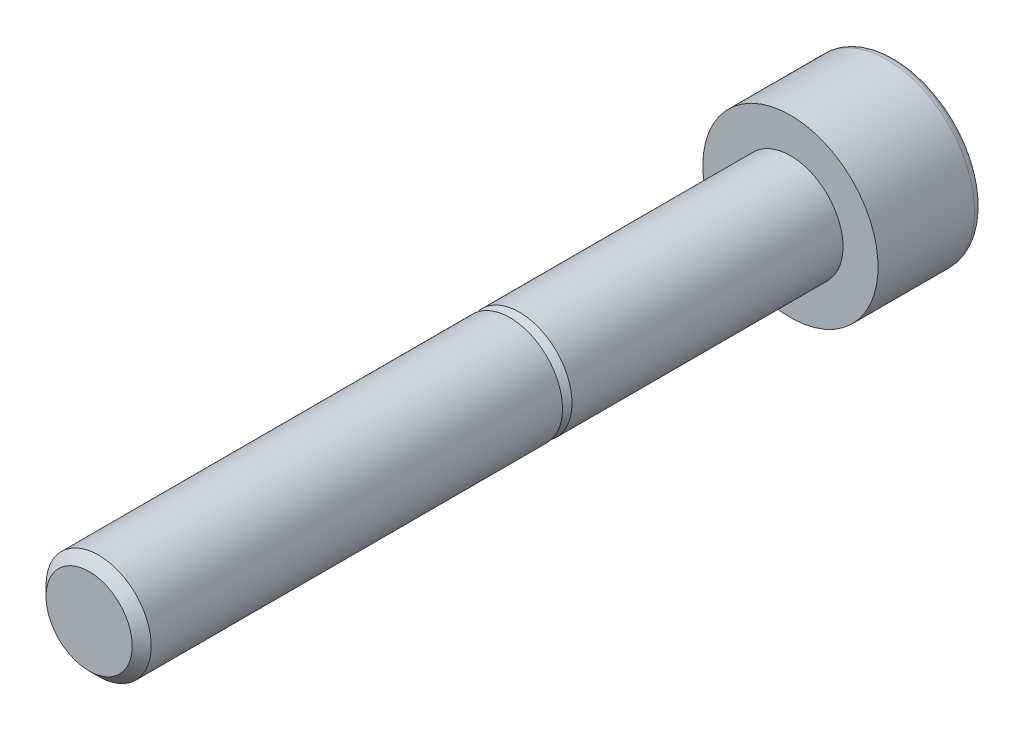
ISO-10303-21;
HEADER;
FILE_DESCRIPTION(('STEP AP214'),'2;1');
FILE_NAME('part.step','',(''),(''),'','','');
FILE_SCHEMA(('AUTOMOTIVE_DESIGN { 1 0 10303 214 1 1 1 1 }'));
ENDSEC;
DATA;
#1=APPLICATION_CONTEXT('core data for automotive mechanical design processes');
#2=APPLICATION_PROTOCOL_DEFINITION('international standard','automotive_design',2000,#1);
#3=PRODUCT_CONTEXT('',#1,'mechanical');
#4=PRODUCT('Part','Part','',(#3));
#5=PRODUCT_RELATED_PRODUCT_CATEGORY('part','',(#4));
#6=PRODUCT_DEFINITION_FORMATION('','',#4);
#7=PRODUCT_DEFINITION_CONTEXT('part definition',#1,'design');
#8=PRODUCT_DEFINITION('design','',#6,#7);
#9=PRODUCT_DEFINITION_SHAPE('','',#8);
#10=(LENGTH_UNIT() NAMED_UNIT(*) SI_UNIT(.MILLI.,.METRE.));
#11=(NAMED_UNIT(*) PLANE_ANGLE_UNIT() SI_UNIT($,.RADIAN.));
#12=(NAMED_UNIT(*) SI_UNIT($,.STERADIAN.) SOLID_ANGLE_UNIT());
#13=UNCERTAINTY_MEASURE_WITH_UNIT(LENGTH_MEASURE(1.E-05),#10,'distance_accuracy_value','');
#14=(GEOMETRIC_REPRESENTATION_CONTEXT(3) GLOBAL_UNCERTAINTY_ASSIGNED_CONTEXT((#13)) GLOBAL_UNIT_ASSIGNED_CONTEXT((#10,
#11,#12)) REPRESENTATION_CONTEXT('',''));
#15=CARTESIAN_POINT('',(0.,0.,0.));
#16=DIRECTION('',(0.,0.,1.));
#17=DIRECTION('',(1.,0.,0.));
#18=AXIS2_PLACEMENT_3D('',#15,#16,#17);
#19=CARTESIAN_POINT('',(0.,4.5,-6.));
#20=DIRECTION('',(0.,0.,1.));
#21=DIRECTION('',(1.,0.,0.));
#22=AXIS2_PLACEMENT_3D('',#19,#20,#21);
#23=PLANE('',#22);
#24=CARTESIAN_POINT('',(0.,0.,-6.));
#25=DIRECTION('',(0.,0.,-1.));
#26=DIRECTION('',(-1.,0.,0.));
#27=AXIS2_PLACEMENT_3D('',#24,#25,#26);
#28=CIRCLE('',#27,4.5);
#29=CARTESIAN_POINT('',(-4.5,0.,-6.));
#30=VERTEX_POINT('',#29);
#31=EDGE_CURVE('E107',#30,#30,#28,.T.);
#32=ORIENTED_EDGE('',*,*,#31,.T.);
#33=EDGE_LOOP('',(#32));
#34=FACE_BOUND('',#33,.T.);
#35=DIRECTION('',(-0.5,-0.866025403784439,0.));
#36=VECTOR('',#35,1.);
#37=CARTESIAN_POINT('',(-1.443375,2.49999883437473,-6.));
#38=LINE('',#37,#36);
#39=CARTESIAN_POINT('',(-1.443375,2.49999883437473,-6.));
#40=VERTEX_POINT('',#39);
#41=CARTESIAN_POINT('',(-2.88675,0.,-6.));
#42=VERTEX_POINT('',#41);
#43=EDGE_CURVE('E30',#40,#42,#38,.T.);
#44=ORIENTED_EDGE('',*,*,#43,.T.);
#45=DIRECTION('',(0.5,-0.866025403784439,0.));
#46=VECTOR('',#45,1.);
#47=CARTESIAN_POINT('',(-2.88675,0.,-6.));
#48=LINE('',#47,#46);
#49=CARTESIAN_POINT('',(-1.443375,-2.49999883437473,-6.));
#50=VERTEX_POINT('',#49);
#51=EDGE_CURVE('E153',#42,#50,#48,.T.);
#52=ORIENTED_EDGE('',*,*,#51,.T.);
#53=DIRECTION('',(1.,0.,0.));
#54=VECTOR('',#53,1.);
#55=CARTESIAN_POINT('',(-1.443375,-2.49999883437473,-6.));
#56=LINE('',#55,#54);
#57=CARTESIAN_POINT('',(1.443375,-2.49999883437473,-6.));
#58=VERTEX_POINT('',#57);
#59=EDGE_CURVE('E155',#50,#58,#56,.T.);
#60=ORIENTED_EDGE('',*,*,#59,.T.);
#61=DIRECTION('',(0.5,0.866025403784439,0.));
#62=VECTOR('',#61,1.);
#63=CARTESIAN_POINT('',(1.443375,-2.49999883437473,-6.));
#64=LINE('',#63,#62);
#65=CARTESIAN_POINT('',(2.88675,0.,-6.));
#66=VERTEX_POINT('',#65);
#67=EDGE_CURVE('E157',#58,#66,#64,.T.);
#68=ORIENTED_EDGE('',*,*,#67,.T.);
#69=DIRECTION('',(-0.5,0.866025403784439,0.));
#70=VECTOR('',#69,1.);
#71=CARTESIAN_POINT('',(2.88675,0.,-6.));
#72=LINE('',#71,#70);
#73=CARTESIAN_POINT('',(1.443375,2.49999883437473,-6.));
#74=VERTEX_POINT('',#73);
#75=EDGE_CURVE('E96',#66,#74,#72,.T.);
#76=ORIENTED_EDGE('',*,*,#75,.T.);
#77=DIRECTION('',(-1.,0.,0.));
#78=VECTOR('',#77,1.);
#79=CARTESIAN_POINT('',(1.443375,2.49999883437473,-6.));
#80=LINE('',#79,#78);
#81=EDGE_CURVE('E92',#74,#40,#80,.T.);
#82=ORIENTED_EDGE('',*,*,#81,.T.);
#83=EDGE_LOOP('',(#44,#52,#60,#68,#76,#82));
#84=FACE_BOUND('',#83,.T.);
#85=ADVANCED_FACE('F16',(#34,#84),#23,.F.);
#86=CARTESIAN_POINT('',(0.,0.,-6.));
#87=DIRECTION('',(0.,0.,-1.));
#88=DIRECTION('',(-1.,0.,0.));
#89=AXIS2_PLACEMENT_3D('',#86,#87,#88);
#90=CYLINDRICAL_SURFACE('',#89,3.);
#91=CARTESIAN_POINT('',(0.,0.,15.45875));
#92=DIRECTION('',(0.,0.,-1.));
#93=DIRECTION('',(-1.,0.,0.));
#94=AXIS2_PLACEMENT_3D('',#91,#92,#93);
#95=CIRCLE('',#94,3.);
#96=CARTESIAN_POINT('',(-3.,0.,15.45875));
#97=VERTEX_POINT('',#96);
#98=EDGE_CURVE('E188',#97,#97,#95,.T.);
#99=ORIENTED_EDGE('',*,*,#98,.T.);
#100=EDGE_LOOP('',(#99));
#101=FACE_BOUND('',#100,.T.);
#102=CARTESIAN_POINT('',(0.,0.,0.));
#103=DIRECTION('',(0.,0.,-1.));
#104=DIRECTION('',(-1.,0.,0.));
#105=AXIS2_PLACEMENT_3D('',#102,#103,#104);
#106=CIRCLE('',#105,3.);
#107=CARTESIAN_POINT('',(-3.,0.,0.));
#108=VERTEX_POINT('',#107);
#109=EDGE_CURVE('E116',#108,#108,#106,.T.);
#110=ORIENTED_EDGE('',*,*,#109,.F.);
#111=EDGE_LOOP('',(#110));
#112=FACE_BOUND('',#111,.T.);
#113=ADVANCED_FACE('F140',(#101,#112),#90,.T.);
#114=CARTESIAN_POINT('',(0.,3.,0.));
#115=DIRECTION('',(0.,0.,-1.));
#116=DIRECTION('',(-1.,0.,0.));
#117=AXIS2_PLACEMENT_3D('',#114,#115,#116);
#118=PLANE('',#117);
#119=CARTESIAN_POINT('',(0.,0.,0.));
#120=DIRECTION('',(0.,0.,-1.));
#121=DIRECTION('',(-1.,0.,0.));
#122=AXIS2_PLACEMENT_3D('',#119,#120,#121);
#123=CIRCLE('',#122,5.);
#124=CARTESIAN_POINT('',(-5.,0.,0.));
#125=VERTEX_POINT('',#124);
#126=EDGE_CURVE('E113',#125,#125,#123,.T.);
#127=ORIENTED_EDGE('',*,*,#126,.F.);
#128=EDGE_LOOP('',(#127));
#129=FACE_BOUND('',#128,.T.);
#130=ORIENTED_EDGE('',*,*,#109,.T.);
#131=EDGE_LOOP('',(#130));
#132=FACE_BOUND('',#131,.T.);
#133=ADVANCED_FACE('F145',(#129,#132),#118,.F.);
#134=CARTESIAN_POINT('',(0.,0.,-6.));
#135=DIRECTION('',(0.,0.,-1.));
#136=DIRECTION('',(-1.,0.,0.));
#137=AXIS2_PLACEMENT_3D('',#134,#135,#136);
#138=CYLINDRICAL_SURFACE('',#137,5.);
#139=CARTESIAN_POINT('',(0.,0.,-5.5));
#140=DIRECTION('',(0.,0.,-1.));
#141=DIRECTION('',(-1.,0.,0.));
#142=AXIS2_PLACEMENT_3D('',#139,#140,#141);
#143=CIRCLE('',#142,5.);
#144=CARTESIAN_POINT('',(-5.,0.,-5.5));
#145=VERTEX_POINT('',#144);
#146=EDGE_CURVE('E110',#145,#145,#143,.T.);
#147=ORIENTED_EDGE('',*,*,#146,.F.);
#148=EDGE_LOOP('',(#147));
#149=FACE_BOUND('',#148,.T.);
#150=ORIENTED_EDGE('',*,*,#126,.T.);
#151=EDGE_LOOP('',(#150));
#152=FACE_BOUND('',#151,.T.);
#153=ADVANCED_FACE('F229',(#149,#152),#138,.T.);
#154=CARTESIAN_POINT('',(0.,0.,-5.5));
#155=DIRECTION('',(0.,0.,-1.));
#156=DIRECTION('',(-1.,0.,0.));
#157=AXIS2_PLACEMENT_3D('',#154,#155,#156);
#158=TOROIDAL_SURFACE('',#157,4.5,0.5);
#159=ORIENTED_EDGE('',*,*,#31,.F.);
#160=EDGE_LOOP('',(#159));
#161=FACE_BOUND('',#160,.T.);
#162=ORIENTED_EDGE('',*,*,#146,.T.);
#163=EDGE_LOOP('',(#162));
#164=FACE_BOUND('',#163,.T.);
#165=ADVANCED_FACE('F226',(#161,#164),#158,.T.);
#166=CARTESIAN_POINT('',(-1.443375,2.49999883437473,-1.33333411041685));
#167=DIRECTION('',(0.866025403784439,-0.5,0.));
#168=DIRECTION('',(0.5,0.866025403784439,0.));
#169=AXIS2_PLACEMENT_3D('',#166,#167,#168);
#170=PLANE('',#169);
#171=DIRECTION('',(0.,0.,-1.));
#172=VECTOR('',#171,1.);
#173=CARTESIAN_POINT('',(-2.88675,0.,-1.33333411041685));
#174=LINE('',#173,#172);
#175=CARTESIAN_POINT('',(-2.88675,0.,-3.));
#176=VERTEX_POINT('',#175);
#177=EDGE_CURVE('E105',#176,#42,#174,.T.);
#178=ORIENTED_EDGE('',*,*,#177,.T.);
#179=ORIENTED_EDGE('',*,*,#43,.F.);
#180=DIRECTION('',(0.,0.,-1.));
#181=VECTOR('',#180,1.);
#182=CARTESIAN_POINT('',(-1.443375,2.49999883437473,-1.33333411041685));
#183=LINE('',#182,#181);
#184=CARTESIAN_POINT('',(-1.443375,2.49999883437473,-3.));
#185=VERTEX_POINT('',#184);
#186=EDGE_CURVE('E86',#185,#40,#183,.T.);
#187=ORIENTED_EDGE('',*,*,#186,.F.);
#188=CARTESIAN_POINT('',(-2.88675011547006,-1.99999999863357E-07,-3.00000006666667));
#189=CARTESIAN_POINT('',(-2.82332252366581,0.10985961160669,-2.96336950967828));
#190=CARTESIAN_POINT('',(-2.75934742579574,0.220667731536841,-2.93005593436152));
#191=CARTESIAN_POINT('',(-2.63028954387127,0.444202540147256,-2.87190808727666));
#192=CARTESIAN_POINT('',(-2.56520446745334,0.556933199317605,-2.84709438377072));
#193=CARTESIAN_POINT('',(-2.43584088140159,0.780997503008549,-2.80847006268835));
#194=CARTESIAN_POINT('',(-2.37158227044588,0.892296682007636,-2.7944023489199));
#195=CARTESIAN_POINT('',(-2.24276284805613,1.11541846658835,-2.77761157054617));
#196=CARTESIAN_POINT('',(-2.17820250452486,1.22724026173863,-2.77487459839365));
#197=CARTESIAN_POINT('',(-2.05757841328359,1.43616731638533,-2.78058295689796));
#198=CARTESIAN_POINT('',(-2.00149656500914,1.53330392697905,-2.7876266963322));
#199=CARTESIAN_POINT('',(-1.8896982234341,1.72694433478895,-2.80994670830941));
#200=CARTESIAN_POINT('',(-1.83398211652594,1.82344746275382,-2.82523059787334));
#201=CARTESIAN_POINT('',(-1.72195345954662,2.01748678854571,-2.86343736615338));
#202=CARTESIAN_POINT('',(-1.66565508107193,2.11499844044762,-2.88652212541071));
#203=CARTESIAN_POINT('',(-1.55389777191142,2.3085677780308,-2.93891477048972));
#204=CARTESIAN_POINT('',(-1.49843741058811,2.40462794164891,-2.96821035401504));
#205=CARTESIAN_POINT('',(-1.44337488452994,2.49999903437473,-3.00000006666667));
#206=B_SPLINE_CURVE_WITH_KNOTS('',3,(#188,#189,#190,#191,#192,#193,#194,#195,#196,#197,#198,
#199,#200,#201,#202,#203,#204,#205),.UNSPECIFIED.,.F.,.F.,(4,2,2,2,2,2,2,2,4),(0.,
0.396269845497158,0.793491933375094,1.18088400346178,1.56780044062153,1.90463400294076,
2.24177946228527,2.58640119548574,2.93034658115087),.UNSPECIFIED.);
#207=EDGE_CURVE('E79',#176,#185,#206,.T.);
#208=ORIENTED_EDGE('',*,*,#207,.F.);
#209=EDGE_LOOP('',(#178,#179,#187,#208));
#210=FACE_BOUND('',#209,.T.);
#211=ADVANCED_FACE('F87',(#210),#170,.T.);
#212=CARTESIAN_POINT('',(-2.88675,0.,-1.33333411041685));
#213=DIRECTION('',(0.866025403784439,0.5,0.));
#214=DIRECTION('',(-0.5,0.866025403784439,0.));
#215=AXIS2_PLACEMENT_3D('',#212,#213,#214);
#216=PLANE('',#215);
#217=DIRECTION('',(0.,0.,-1.));
#218=VECTOR('',#217,1.);
#219=CARTESIAN_POINT('',(-1.443375,-2.49999883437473,-1.33333411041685));
#220=LINE('',#219,#218);
#221=CARTESIAN_POINT('',(-1.443375,-2.49999883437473,-3.));
#222=VERTEX_POINT('',#221);
#223=EDGE_CURVE('E103',#222,#50,#220,.T.);
#224=ORIENTED_EDGE('',*,*,#223,.T.);
#225=ORIENTED_EDGE('',*,*,#51,.F.);
#226=ORIENTED_EDGE('',*,*,#177,.F.);
#227=CARTESIAN_POINT('',(-1.44337488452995,-2.49999903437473,-3.00000006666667));
#228=CARTESIAN_POINT('',(-1.50680247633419,-2.39013922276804,-2.96336950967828));
#229=CARTESIAN_POINT('',(-1.57077757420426,-2.27933110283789,-2.93005593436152));
#230=CARTESIAN_POINT('',(-1.69983545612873,-2.05579629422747,-2.87190808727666));
#231=CARTESIAN_POINT('',(-1.76492053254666,-1.94306563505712,-2.84709438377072));
#232=CARTESIAN_POINT('',(-1.89428411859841,-1.71900133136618,-2.80847006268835));
#233=CARTESIAN_POINT('',(-1.95854272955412,-1.60770215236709,-2.7944023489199));
#234=CARTESIAN_POINT('',(-2.08736215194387,-1.38458036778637,-2.77761157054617));
#235=CARTESIAN_POINT('',(-2.15192249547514,-1.2727585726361,-2.77487459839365));
#236=CARTESIAN_POINT('',(-2.27254658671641,-1.06383151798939,-2.78058295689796));
#237=CARTESIAN_POINT('',(-2.32862843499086,-0.966694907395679,-2.7876266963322));
#238=CARTESIAN_POINT('',(-2.4404267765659,-0.773054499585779,-2.8099467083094));
#239=CARTESIAN_POINT('',(-2.49614288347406,-0.676551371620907,-2.82523059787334));
#240=CARTESIAN_POINT('',(-2.60817154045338,-0.48251204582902,-2.86343736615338));
#241=CARTESIAN_POINT('',(-2.66446991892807,-0.385000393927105,-2.88652212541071));
#242=CARTESIAN_POINT('',(-2.77622722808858,-0.191431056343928,-2.93891477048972));
#243=CARTESIAN_POINT('',(-2.83168758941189,-0.0953708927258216,-2.96821035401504));
#244=CARTESIAN_POINT('',(-2.88675011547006,1.99999999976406E-07,-3.00000006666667));
#245=B_SPLINE_CURVE_WITH_KNOTS('',3,(#227,#228,#229,#230,#231,#232,#233,#234,#235,#236,#237,
#238,#239,#240,#241,#242,#243,#244),.UNSPECIFIED.,.F.,.F.,(4,2,2,2,2,2,2,2,4),(0.,
0.396269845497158,0.793491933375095,1.18088400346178,1.56780044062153,1.90463400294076,
2.24177946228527,2.58640119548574,2.93034658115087),.UNSPECIFIED.);
#246=EDGE_CURVE('E83',#222,#176,#245,.T.);
#247=ORIENTED_EDGE('',*,*,#246,.F.);
#248=EDGE_LOOP('',(#224,#225,#226,#247));
#249=FACE_BOUND('',#248,.T.);
#250=ADVANCED_FACE('F212',(#249),#216,.T.);
#251=CARTESIAN_POINT('',(-1.443375,-2.49999883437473,-1.33333411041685));
#252=DIRECTION('',(0.,1.,0.));
#253=DIRECTION('',(-1.,0.,0.));
#254=AXIS2_PLACEMENT_3D('',#251,#252,#253);
#255=PLANE('',#254);
#256=DIRECTION('',(0.,0.,-1.));
#257=VECTOR('',#256,1.);
#258=CARTESIAN_POINT('',(1.443375,-2.49999883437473,-1.33333411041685));
#259=LINE('',#258,#257);
#260=CARTESIAN_POINT('',(1.443375,-2.49999883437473,-3.));
#261=VERTEX_POINT('',#260);
#262=EDGE_CURVE('E101',#261,#58,#259,.T.);
#263=ORIENTED_EDGE('',*,*,#262,.T.);
#264=ORIENTED_EDGE('',*,*,#59,.F.);
#265=ORIENTED_EDGE('',*,*,#223,.F.);
#266=CARTESIAN_POINT('',(3.73786106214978,-2.49999883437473,-3.92958778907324));
#267=CARTESIAN_POINT('',(3.62990250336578,-2.49999883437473,-3.87779335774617));
#268=CARTESIAN_POINT('',(3.52168094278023,-2.49999883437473,-3.82653690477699));
#269=CARTESIAN_POINT('',(3.30457164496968,-2.49999883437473,-3.72540514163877));
#270=CARTESIAN_POINT('',(3.1956837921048,-2.49999883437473,-3.67553008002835));
#271=CARTESIAN_POINT('',(2.97647740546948,-2.49999883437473,-3.57718765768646));
#272=CARTESIAN_POINT('',(2.86615419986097,-2.49999883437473,-3.52873067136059));
#273=CARTESIAN_POINT('',(2.64458202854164,-2.49999883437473,-3.43398963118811));
#274=CARTESIAN_POINT('',(2.5333331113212,-2.49999883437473,-3.38770546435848));
#275=CARTESIAN_POINT('',(2.30680205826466,-2.49999883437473,-3.29671007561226));
#276=CARTESIAN_POINT('',(2.19149052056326,-2.49999883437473,-3.25207161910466));
#277=CARTESIAN_POINT('',(1.95947266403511,-2.49999883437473,-3.16650598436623));
#278=CARTESIAN_POINT('',(1.84276618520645,-2.49999883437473,-3.12557923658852));
#279=CARTESIAN_POINT('',(1.60804233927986,-2.49999883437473,-3.04860739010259));
#280=CARTESIAN_POINT('',(1.49002871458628,-2.49999883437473,-3.01255100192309));
#281=CARTESIAN_POINT('',(1.25231014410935,-2.49999883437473,-2.94655294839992));
#282=CARTESIAN_POINT('',(1.13260562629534,-2.49999883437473,-2.91660976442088));
#283=CARTESIAN_POINT('',(0.891754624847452,-2.49999883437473,-2.86443431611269));
#284=CARTESIAN_POINT('',(0.770611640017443,-2.49999883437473,-2.84218621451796));
#285=CARTESIAN_POINT('',(0.526970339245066,-2.49999883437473,-2.80685777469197));
#286=CARTESIAN_POINT('',(0.404472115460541,-2.49999883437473,-2.79377681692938));
#287=CARTESIAN_POINT('',(0.160266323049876,-2.49999883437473,-2.77799632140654));
#288=CARTESIAN_POINT('',(0.0385668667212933,-2.49999883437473,-2.77517427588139));
#289=CARTESIAN_POINT('',(-0.204641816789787,-2.49999883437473,-2.77983589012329));
#290=CARTESIAN_POINT('',(-0.326151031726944,-2.49999883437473,-2.78732018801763));
#291=CARTESIAN_POINT('',(-0.536550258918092,-2.49999883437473,-2.80869871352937));
#292=CARTESIAN_POINT('',(-0.625672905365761,-2.49999883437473,-2.82040889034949));
#293=CARTESIAN_POINT('',(-0.803172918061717,-2.49999883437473,-2.84856827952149));
#294=CARTESIAN_POINT('',(-0.891550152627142,-2.49999883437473,-2.86501831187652));
#295=CARTESIAN_POINT('',(-1.15551819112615,-2.49999883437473,-2.92060817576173));
#296=CARTESIAN_POINT('',(-1.32980784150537,-2.49999883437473,-2.96597208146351));
#297=CARTESIAN_POINT('',(-1.59042319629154,-2.49999883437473,-3.04347409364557));
#298=CARTESIAN_POINT('',(-1.67812270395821,-2.49999883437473,-3.07124565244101));
#299=CARTESIAN_POINT('',(-1.85261386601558,-2.49999883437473,-3.12935698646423));
#300=CARTESIAN_POINT('',(-1.93940604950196,-2.49999883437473,-3.15969515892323));
#301=CARTESIAN_POINT('',(-2.11219208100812,-2.49999883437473,-3.22250012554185));
#302=CARTESIAN_POINT('',(-2.19818607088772,-2.49999883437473,-3.25496653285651));
#303=CARTESIAN_POINT('',(-2.36949689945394,-2.49999883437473,-3.32167630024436));
#304=CARTESIAN_POINT('',(-2.45481362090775,-2.49999883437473,-3.3559199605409));
#305=CARTESIAN_POINT('',(-2.67258663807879,-2.49999883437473,-3.44552247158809));
#306=CARTESIAN_POINT('',(-2.80460718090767,-2.49999883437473,-3.50193902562));
#307=CARTESIAN_POINT('',(-3.06745885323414,-2.49999883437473,-3.61748625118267));
#308=CARTESIAN_POINT('',(-3.19828989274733,-2.49999883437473,-3.67661712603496));
#309=CARTESIAN_POINT('',(-3.45900849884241,-2.49999883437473,-3.79697660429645));
#310=CARTESIAN_POINT('',(-3.58889589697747,-2.49999883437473,-3.85820557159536));
#311=CARTESIAN_POINT('',(-3.84788845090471,-2.49999883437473,-3.98229868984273));
#312=CARTESIAN_POINT('',(-3.97699358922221,-2.49999883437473,-4.04516287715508));
#313=CARTESIAN_POINT('',(-4.36366789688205,-2.49999883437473,-4.2358316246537));
#314=CARTESIAN_POINT('',(-4.62028438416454,-2.49999883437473,-4.36556637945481));
#315=CARTESIAN_POINT('',(-5.1317603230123,-2.49999883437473,-4.62835381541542));
#316=CARTESIAN_POINT('',(-5.3866199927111,-2.49999883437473,-4.76140607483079));
#317=CARTESIAN_POINT('',(-5.87112445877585,-2.49999883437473,-5.01714627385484));
#318=CARTESIAN_POINT('',(-6.10087872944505,-2.49999883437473,-5.13962714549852));
#319=CARTESIAN_POINT('',(-6.55964828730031,-2.49999883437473,-5.3859833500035));
#320=CARTESIAN_POINT('',(-6.78866354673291,-2.49999883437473,-5.5098587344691));
#321=CARTESIAN_POINT('',(-7.24554286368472,-2.49999883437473,-5.75833893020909));
#322=CARTESIAN_POINT('',(-7.47340836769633,-2.49999883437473,-5.88294108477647));
#323=CARTESIAN_POINT('',(-7.92867868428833,-2.49999883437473,-6.13295637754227));
#324=CARTESIAN_POINT('',(-8.15608352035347,-2.49999883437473,-6.25836947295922));
#325=CARTESIAN_POINT('',(-8.38332285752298,-2.49999883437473,-6.38407980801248));
#326=B_SPLINE_CURVE_WITH_KNOTS('',3,(#266,#267,#268,#269,#270,#271,#272,#273,#274,#275,#276,
#277,#278,#279,#280,#281,#282,#283,#284,#285,#286,#287,#288,#289,#290,#291,#292,#293,#294,#295,
#296,#297,#298,#299,#300,#301,#302,#303,#304,#305,#306,#307,#308,#309,#310,#311,#312,#313,#314,
#315,#316,#317,#318,#319,#320,#321,#322,#323,#324,#325),.UNSPECIFIED.,.F.,.F.,(4,2,2,2,2,2,2,2,
2,2,2,2,2,2,2,2,2,2,2,2,2,2,2,2,2,2,2,2,2,4),(0.,0.359225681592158,0.718515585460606,
1.07998495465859,1.44143550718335,1.81233642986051,2.18328031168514,2.55334902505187,
2.92332569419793,3.29253631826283,3.66172198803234,4.02648423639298,4.39126907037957,
4.66080188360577,4.93038135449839,5.46995360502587,5.74590907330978,6.02169347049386,
6.29742787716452,6.5732090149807,7.00387398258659,7.43457126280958,7.86534362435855,
8.2961255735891,9.15872149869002,10.0212083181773,10.8022890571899,11.583398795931,
12.3625217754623,13.1416039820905),.UNSPECIFIED.);
#327=EDGE_CURVE('E200',#261,#222,#326,.T.);
#328=ORIENTED_EDGE('',*,*,#327,.F.);
#329=EDGE_LOOP('',(#263,#264,#265,#328));
#330=FACE_BOUND('',#329,.T.);
#331=ADVANCED_FACE('F207',(#330),#255,.T.);
#332=CARTESIAN_POINT('',(1.443375,-2.49999883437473,-1.33333411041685));
#333=DIRECTION('',(-0.866025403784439,0.5,0.));
#334=DIRECTION('',(-0.5,-0.866025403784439,0.));
#335=AXIS2_PLACEMENT_3D('',#332,#333,#334);
#336=PLANE('',#335);
#337=DIRECTION('',(0.,0.,-1.));
#338=VECTOR('',#337,1.);
#339=CARTESIAN_POINT('',(2.88675,0.,-1.33333411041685));
#340=LINE('',#339,#338);
#341=CARTESIAN_POINT('',(2.88675,0.,-3.));
#342=VERTEX_POINT('',#341);
#343=EDGE_CURVE('E94',#342,#66,#340,.T.);
#344=ORIENTED_EDGE('',*,*,#343,.T.);
#345=ORIENTED_EDGE('',*,*,#67,.F.);
#346=ORIENTED_EDGE('',*,*,#262,.F.);
#347=CARTESIAN_POINT('',(2.88675011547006,2.E-07,-3.00000006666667));
#348=CARTESIAN_POINT('',(2.82332252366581,-0.10985961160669,-2.96336950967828));
#349=CARTESIAN_POINT('',(2.75934742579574,-0.220667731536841,-2.93005593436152));
#350=CARTESIAN_POINT('',(2.63028954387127,-0.444202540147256,-2.87190808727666));
#351=CARTESIAN_POINT('',(2.56520446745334,-0.556933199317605,-2.84709438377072));
#352=CARTESIAN_POINT('',(2.43584088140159,-0.78099750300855,-2.80847006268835));
#353=CARTESIAN_POINT('',(2.37158227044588,-0.892296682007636,-2.7944023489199));
#354=CARTESIAN_POINT('',(2.24276284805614,-1.11541846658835,-2.77761157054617));
#355=CARTESIAN_POINT('',(2.17820250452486,-1.22724026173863,-2.77487459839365));
#356=CARTESIAN_POINT('',(2.05757841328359,-1.43616731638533,-2.78058295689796));
#357=CARTESIAN_POINT('',(2.00149656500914,-1.53330392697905,-2.7876266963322));
#358=CARTESIAN_POINT('',(1.8896982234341,-1.72694433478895,-2.80994670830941));
#359=CARTESIAN_POINT('',(1.83398211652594,-1.82344746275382,-2.82523059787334));
#360=CARTESIAN_POINT('',(1.72195345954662,-2.01748678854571,-2.86343736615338));
#361=CARTESIAN_POINT('',(1.66565508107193,-2.11499844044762,-2.88652212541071));
#362=CARTESIAN_POINT('',(1.55389777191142,-2.3085677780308,-2.93891477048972));
#363=CARTESIAN_POINT('',(1.49843741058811,-2.40462794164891,-2.96821035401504));
#364=CARTESIAN_POINT('',(1.44337488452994,-2.49999903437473,-3.00000006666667));
#365=B_SPLINE_CURVE_WITH_KNOTS('',3,(#347,#348,#349,#350,#351,#352,#353,#354,#355,#356,#357,
#358,#359,#360,#361,#362,#363,#364),.UNSPECIFIED.,.F.,.F.,(4,2,2,2,2,2,2,2,4),(0.,
0.396269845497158,0.793491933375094,1.18088400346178,1.56780044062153,1.90463400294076,
2.24177946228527,2.58640119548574,2.93034658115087),.UNSPECIFIED.);
#366=EDGE_CURVE('E194',#342,#261,#365,.T.);
#367=ORIENTED_EDGE('',*,*,#366,.F.);
#368=EDGE_LOOP('',(#344,#345,#346,#367));
#369=FACE_BOUND('',#368,.T.);
#370=ADVANCED_FACE('F175',(#369),#336,.T.);
#371=CARTESIAN_POINT('',(2.88675,0.,-1.33333411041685));
#372=DIRECTION('',(-0.866025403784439,-0.5,0.));
#373=DIRECTION('',(0.5,-0.866025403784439,0.));
#374=AXIS2_PLACEMENT_3D('',#371,#372,#373);
#375=PLANE('',#374);
#376=DIRECTION('',(0.,0.,-1.));
#377=VECTOR('',#376,1.);
#378=CARTESIAN_POINT('',(1.443375,2.49999883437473,-1.33333411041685));
#379=LINE('',#378,#377);
#380=CARTESIAN_POINT('',(1.443375,2.49999883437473,-3.));
#381=VERTEX_POINT('',#380);
#382=EDGE_CURVE('E91',#381,#74,#379,.T.);
#383=ORIENTED_EDGE('',*,*,#382,.T.);
#384=ORIENTED_EDGE('',*,*,#75,.F.);
#385=ORIENTED_EDGE('',*,*,#343,.F.);
#386=CARTESIAN_POINT('',(1.44337488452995,2.49999903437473,-3.00000006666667));
#387=CARTESIAN_POINT('',(1.50680247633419,2.39013922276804,-2.96336950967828));
#388=CARTESIAN_POINT('',(1.57077757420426,2.27933110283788,-2.93005593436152));
#389=CARTESIAN_POINT('',(1.69983545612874,2.05579629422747,-2.87190808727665));
#390=CARTESIAN_POINT('',(1.76492053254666,1.94306563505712,-2.84709438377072));
#391=CARTESIAN_POINT('',(1.89428411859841,1.71900133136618,-2.80847006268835));
#392=CARTESIAN_POINT('',(1.95854272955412,1.60770215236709,-2.7944023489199));
#393=CARTESIAN_POINT('',(2.08736215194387,1.38458036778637,-2.77761157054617));
#394=CARTESIAN_POINT('',(2.15192249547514,1.2727585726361,-2.77487459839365));
#395=CARTESIAN_POINT('',(2.27254658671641,1.06383151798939,-2.78058295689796));
#396=CARTESIAN_POINT('',(2.32862843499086,0.966694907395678,-2.7876266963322));
#397=CARTESIAN_POINT('',(2.4404267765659,0.773054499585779,-2.8099467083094));
#398=CARTESIAN_POINT('',(2.49614288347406,0.676551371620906,-2.82523059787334));
#399=CARTESIAN_POINT('',(2.60817154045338,0.48251204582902,-2.86343736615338));
#400=CARTESIAN_POINT('',(2.66446991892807,0.385000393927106,-2.88652212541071));
#401=CARTESIAN_POINT('',(2.77622722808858,0.191431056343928,-2.93891477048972));
#402=CARTESIAN_POINT('',(2.83168758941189,0.0953708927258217,-2.96821035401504));
#403=CARTESIAN_POINT('',(2.88675011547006,-2.00000000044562E-07,-3.00000006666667));
#404=B_SPLINE_CURVE_WITH_KNOTS('',3,(#386,#387,#388,#389,#390,#391,#392,#393,#394,#395,#396,
#397,#398,#399,#400,#401,#402,#403),.UNSPECIFIED.,.F.,.F.,(4,2,2,2,2,2,2,2,4),(0.,
0.396269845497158,0.793491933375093,1.18088400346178,1.56780044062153,1.90463400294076,
2.24177946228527,2.58640119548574,2.93034658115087),.UNSPECIFIED.);
#405=EDGE_CURVE('E38',#381,#342,#404,.T.);
#406=ORIENTED_EDGE('',*,*,#405,.F.);
#407=EDGE_LOOP('',(#383,#384,#385,#406));
#408=FACE_BOUND('',#407,.T.);
#409=ADVANCED_FACE('F169',(#408),#375,.T.);
#410=CARTESIAN_POINT('',(1.443375,2.49999883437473,-1.33333411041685));
#411=DIRECTION('',(0.,-1.,0.));
#412=DIRECTION('',(1.,0.,0.));
#413=AXIS2_PLACEMENT_3D('',#410,#411,#412);
#414=PLANE('',#413);
#415=ORIENTED_EDGE('',*,*,#186,.T.);
#416=ORIENTED_EDGE('',*,*,#81,.F.);
#417=ORIENTED_EDGE('',*,*,#382,.F.);
#418=CARTESIAN_POINT('',(3.73786106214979,2.49999883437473,-3.92958778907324));
#419=CARTESIAN_POINT('',(3.62990250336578,2.49999883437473,-3.87779335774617));
#420=CARTESIAN_POINT('',(3.52168094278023,2.49999883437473,-3.82653690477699));
#421=CARTESIAN_POINT('',(3.30457164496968,2.49999883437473,-3.72540514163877));
#422=CARTESIAN_POINT('',(3.1956837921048,2.49999883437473,-3.67553008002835));
#423=CARTESIAN_POINT('',(2.97647740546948,2.49999883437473,-3.57718765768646));
#424=CARTESIAN_POINT('',(2.86615419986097,2.49999883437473,-3.5287306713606));
#425=CARTESIAN_POINT('',(2.64458202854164,2.49999883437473,-3.43398963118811));
#426=CARTESIAN_POINT('',(2.5333331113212,2.49999883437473,-3.38770546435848));
#427=CARTESIAN_POINT('',(2.30680205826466,2.49999883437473,-3.29671007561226));
#428=CARTESIAN_POINT('',(2.19149052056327,2.49999883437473,-3.25207161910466));
#429=CARTESIAN_POINT('',(1.95947266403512,2.49999883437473,-3.16650598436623));
#430=CARTESIAN_POINT('',(1.84276618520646,2.49999883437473,-3.12557923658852));
#431=CARTESIAN_POINT('',(1.60804233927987,2.49999883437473,-3.04860739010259));
#432=CARTESIAN_POINT('',(1.49002871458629,2.49999883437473,-3.01255100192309));
#433=CARTESIAN_POINT('',(1.25231014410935,2.49999883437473,-2.94655294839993));
#434=CARTESIAN_POINT('',(1.13260562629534,2.49999883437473,-2.91660976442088));
#435=CARTESIAN_POINT('',(0.891754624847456,2.49999883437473,-2.86443431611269));
#436=CARTESIAN_POINT('',(0.770611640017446,2.49999883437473,-2.84218621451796));
#437=CARTESIAN_POINT('',(0.526970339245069,2.49999883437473,-2.80685777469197));
#438=CARTESIAN_POINT('',(0.404472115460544,2.49999883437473,-2.79377681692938));
#439=CARTESIAN_POINT('',(0.160266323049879,2.49999883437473,-2.77799632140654));
#440=CARTESIAN_POINT('',(0.0385668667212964,2.49999883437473,-2.77517427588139));
#441=CARTESIAN_POINT('',(-0.204641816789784,2.49999883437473,-2.77983589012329));
#442=CARTESIAN_POINT('',(-0.326151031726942,2.49999883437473,-2.78732018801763));
#443=CARTESIAN_POINT('',(-0.536550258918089,2.49999883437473,-2.80869871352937));
#444=CARTESIAN_POINT('',(-0.625672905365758,2.49999883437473,-2.82040889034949));
#445=CARTESIAN_POINT('',(-0.803172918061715,2.49999883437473,-2.84856827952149));
#446=CARTESIAN_POINT('',(-0.891550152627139,2.49999883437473,-2.86501831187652));
#447=CARTESIAN_POINT('',(-1.15551819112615,2.49999883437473,-2.92060817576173));
#448=CARTESIAN_POINT('',(-1.32980784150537,2.49999883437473,-2.96597208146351));
#449=CARTESIAN_POINT('',(-1.59042319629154,2.49999883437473,-3.04347409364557));
#450=CARTESIAN_POINT('',(-1.67812270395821,2.49999883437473,-3.07124565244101));
#451=CARTESIAN_POINT('',(-1.85261386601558,2.49999883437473,-3.12935698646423));
#452=CARTESIAN_POINT('',(-1.93940604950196,2.49999883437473,-3.15969515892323));
#453=CARTESIAN_POINT('',(-2.11219208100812,2.49999883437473,-3.22250012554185));
#454=CARTESIAN_POINT('',(-2.19818607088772,2.49999883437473,-3.25496653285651));
#455=CARTESIAN_POINT('',(-2.36949689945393,2.49999883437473,-3.32167630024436));
#456=CARTESIAN_POINT('',(-2.45481362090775,2.49999883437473,-3.3559199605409));
#457=CARTESIAN_POINT('',(-2.67258663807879,2.49999883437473,-3.44552247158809));
#458=CARTESIAN_POINT('',(-2.80460718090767,2.49999883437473,-3.50193902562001));
#459=CARTESIAN_POINT('',(-3.06745885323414,2.49999883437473,-3.61748625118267));
#460=CARTESIAN_POINT('',(-3.19828989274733,2.49999883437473,-3.67661712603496));
#461=CARTESIAN_POINT('',(-3.45900849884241,2.49999883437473,-3.79697660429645));
#462=CARTESIAN_POINT('',(-3.58889589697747,2.49999883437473,-3.85820557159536));
#463=CARTESIAN_POINT('',(-3.84788845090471,2.49999883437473,-3.98229868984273));
#464=CARTESIAN_POINT('',(-3.97699358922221,2.49999883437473,-4.04516287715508));
#465=CARTESIAN_POINT('',(-4.36366789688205,2.49999883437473,-4.2358316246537));
#466=CARTESIAN_POINT('',(-4.62028438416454,2.49999883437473,-4.36556637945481));
#467=CARTESIAN_POINT('',(-5.1317603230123,2.49999883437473,-4.62835381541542));
#468=CARTESIAN_POINT('',(-5.38661999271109,2.49999883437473,-4.76140607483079));
#469=CARTESIAN_POINT('',(-5.87112445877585,2.49999883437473,-5.01714627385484));
#470=CARTESIAN_POINT('',(-6.10087872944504,2.49999883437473,-5.13962714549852));
#471=CARTESIAN_POINT('',(-6.55964828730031,2.49999883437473,-5.3859833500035));
#472=CARTESIAN_POINT('',(-6.78866354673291,2.49999883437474,-5.5098587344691));
#473=CARTESIAN_POINT('',(-7.24554286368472,2.49999883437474,-5.75833893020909));
#474=CARTESIAN_POINT('',(-7.47340836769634,2.49999883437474,-5.88294108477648));
#475=CARTESIAN_POINT('',(-7.92867868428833,2.49999883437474,-6.13295637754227));
#476=CARTESIAN_POINT('',(-8.15608352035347,2.49999883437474,-6.25836947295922));
#477=CARTESIAN_POINT('',(-8.38332285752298,2.49999883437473,-6.38407980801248));
#478=B_SPLINE_CURVE_WITH_KNOTS('',3,(#418,#419,#420,#421,#422,#423,#424,#425,#426,#427,#428,
#429,#430,#431,#432,#433,#434,#435,#436,#437,#438,#439,#440,#441,#442,#443,#444,#445,#446,#447,
#448,#449,#450,#451,#452,#453,#454,#455,#456,#457,#458,#459,#460,#461,#462,#463,#464,#465,#466,
#467,#468,#469,#470,#471,#472,#473,#474,#475,#476,#477),.UNSPECIFIED.,.F.,.F.,(4,2,2,2,2,2,2,2,
2,2,2,2,2,2,2,2,2,2,2,2,2,2,2,2,2,2,2,2,2,4),(0.,0.359225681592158,0.718515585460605,
1.07998495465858,1.44143550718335,1.81233642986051,2.18328031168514,2.55334902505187,
2.92332569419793,3.29253631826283,3.66172198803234,4.02648423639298,4.39126907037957,
4.66080188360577,4.93038135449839,5.46995360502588,5.74590907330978,6.02169347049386,
6.29742787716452,6.5732090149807,7.00387398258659,7.43457126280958,7.86534362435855,
8.2961255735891,9.15872149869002,10.0212083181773,10.8022890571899,11.583398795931,
12.3625217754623,13.1416039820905),.UNSPECIFIED.);
#479=EDGE_CURVE('E80',#185,#381,#478,.F.);
#480=ORIENTED_EDGE('',*,*,#479,.F.);
#481=EDGE_LOOP('',(#415,#416,#417,#480));
#482=FACE_BOUND('',#481,.T.);
#483=ADVANCED_FACE('F75',(#482),#414,.T.);
#484=CARTESIAN_POINT('',(0.,0.,-1.33333411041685));
#485=DIRECTION('',(0.,0.,-1.));
#486=DIRECTION('',(-1.,0.,0.));
#487=AXIS2_PLACEMENT_3D('',#484,#485,#486);
#488=CONICAL_SURFACE('',#487,0.,1.0471975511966);
#489=CARTESIAN_POINT('',(0.,0.,-1.33333411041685));
#490=VERTEX_POINT('',#489);
#491=VERTEX_LOOP('',#490);
#492=FACE_BOUND('',#491,.T.);
#493=ORIENTED_EDGE('',*,*,#207,.T.);
#494=ORIENTED_EDGE('',*,*,#479,.T.);
#495=ORIENTED_EDGE('',*,*,#405,.T.);
#496=ORIENTED_EDGE('',*,*,#366,.T.);
#497=ORIENTED_EDGE('',*,*,#327,.T.);
#498=ORIENTED_EDGE('',*,*,#246,.T.);
#499=EDGE_LOOP('',(#493,#494,#495,#496,#497,#498));
#500=FACE_BOUND('',#499,.T.);
#501=ADVANCED_FACE('F71',(#492,#500),#488,.F.);
#502=CARTESIAN_POINT('',(0.,0.,16.));
#503=DIRECTION('',(0.,0.,-1.));
#504=DIRECTION('',(-1.,0.,0.));
#505=AXIS2_PLACEMENT_3D('',#502,#503,#504);
#506=CONICAL_SURFACE('',#505,2.45875,0.785398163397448);
#507=ORIENTED_EDGE('',*,*,#98,.F.);
#508=EDGE_LOOP('',(#507));
#509=FACE_BOUND('',#508,.T.);
#510=CARTESIAN_POINT('',(0.,0.,16.));
#511=DIRECTION('',(0.,0.,-1.));
#512=DIRECTION('',(-1.,0.,0.));
#513=AXIS2_PLACEMENT_3D('',#510,#511,#512);
#514=CIRCLE('',#513,2.45875);
#515=CARTESIAN_POINT('',(-2.45875,0.,16.));
#516=VERTEX_POINT('',#515);
#517=EDGE_CURVE('E312',#516,#516,#514,.T.);
#518=ORIENTED_EDGE('',*,*,#517,.T.);
#519=EDGE_LOOP('',(#518));
#520=FACE_BOUND('',#519,.T.);
#521=ADVANCED_FACE('F74',(#509,#520),#506,.T.);
#522=CARTESIAN_POINT('',(0.,2.45875,16.));
#523=DIRECTION('',(0.,0.,-1.));
#524=DIRECTION('',(-1.,0.,0.));
#525=AXIS2_PLACEMENT_3D('',#522,#523,#524);
#526=PLANE('',#525);
#527=CARTESIAN_POINT('',(0.,0.,16.));
#528=DIRECTION('',(0.,0.,-1.));
#529=DIRECTION('',(-1.,0.,0.));
#530=AXIS2_PLACEMENT_3D('',#527,#528,#529);
#531=CIRCLE('',#530,3.);
#532=CARTESIAN_POINT('',(-3.,0.,16.));
#533=VERTEX_POINT('',#532);
#534=EDGE_CURVE('E314',#533,#533,#531,.T.);
#535=ORIENTED_EDGE('',*,*,#534,.T.);
#536=EDGE_LOOP('',(#535));
#537=FACE_BOUND('',#536,.T.);
#538=ORIENTED_EDGE('',*,*,#517,.F.);
#539=EDGE_LOOP('',(#538));
#540=FACE_BOUND('',#539,.T.);
#541=ADVANCED_FACE('F132',(#537,#540),#526,.T.);
#542=CARTESIAN_POINT('',(0.,0.,40.));
#543=DIRECTION('',(0.,0.,-1.));
#544=DIRECTION('',(-1.,0.,0.));
#545=AXIS2_PLACEMENT_3D('',#542,#543,#544);
#546=PLANE('',#545);
#547=CARTESIAN_POINT('',(0.,0.,40.));
#548=DIRECTION('',(0.,0.,-1.));
#549=DIRECTION('',(-1.,0.,0.));
#550=AXIS2_PLACEMENT_3D('',#547,#548,#549);
#551=CIRCLE('',#550,2.45875);
#552=CARTESIAN_POINT('',(-2.45875000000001,0.,40.));
#553=VERTEX_POINT('',#552);
#554=EDGE_CURVE('E10',#553,#553,#551,.T.);
#555=ORIENTED_EDGE('',*,*,#554,.F.);
#556=EDGE_LOOP('',(#555));
#557=FACE_BOUND('',#556,.T.);
#558=ADVANCED_FACE('F127',(#557),#546,.F.);
#559=CARTESIAN_POINT('',(0.,0.,40.));
#560=DIRECTION('',(0.,0.,-1.));
#561=DIRECTION('',(-1.,0.,0.));
#562=AXIS2_PLACEMENT_3D('',#559,#560,#561);
#563=CONICAL_SURFACE('',#562,2.45875,0.78539816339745);
#564=CARTESIAN_POINT('',(0.,0.,39.45875));
#565=DIRECTION('',(0.,0.,-1.));
#566=DIRECTION('',(-1.,0.,0.));
#567=AXIS2_PLACEMENT_3D('',#564,#565,#566);
#568=CIRCLE('',#567,3.);
#569=CARTESIAN_POINT('',(-3.00000000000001,0.,39.45875));
#570=VERTEX_POINT('',#569);
#571=EDGE_CURVE('E23',#570,#570,#568,.T.);
#572=ORIENTED_EDGE('',*,*,#571,.F.);
#573=EDGE_LOOP('',(#572));
#574=FACE_BOUND('',#573,.T.);
#575=ORIENTED_EDGE('',*,*,#554,.T.);
#576=EDGE_LOOP('',(#575));
#577=FACE_BOUND('',#576,.T.);
#578=ADVANCED_FACE('F124',(#574,#577),#563,.T.);
#579=ORIENTED_EDGE('',*,*,#571,.T.);
#580=EDGE_LOOP('',(#579));
#581=FACE_BOUND('',#580,.T.);
#582=ORIENTED_EDGE('',*,*,#534,.F.);
#583=EDGE_LOOP('',(#582));
#584=FACE_BOUND('',#583,.T.);
#585=ADVANCED_FACE('F121',(#581,#584),#90,.T.);
#586=CLOSED_SHELL('',(#85,#113,#133,#153,#165,#211,#250,#331,#370,#409,#483,#501,#521,#541,#558,
#578,#585));
#587=MANIFOLD_SOLID_BREP('B1',#586);
#588=ADVANCED_BREP_SHAPE_REPRESENTATION('',(#18,#587),#14);
#589=SHAPE_DEFINITION_REPRESENTATION(#9,#588);
ENDSEC;
END-ISO-10303-21;
